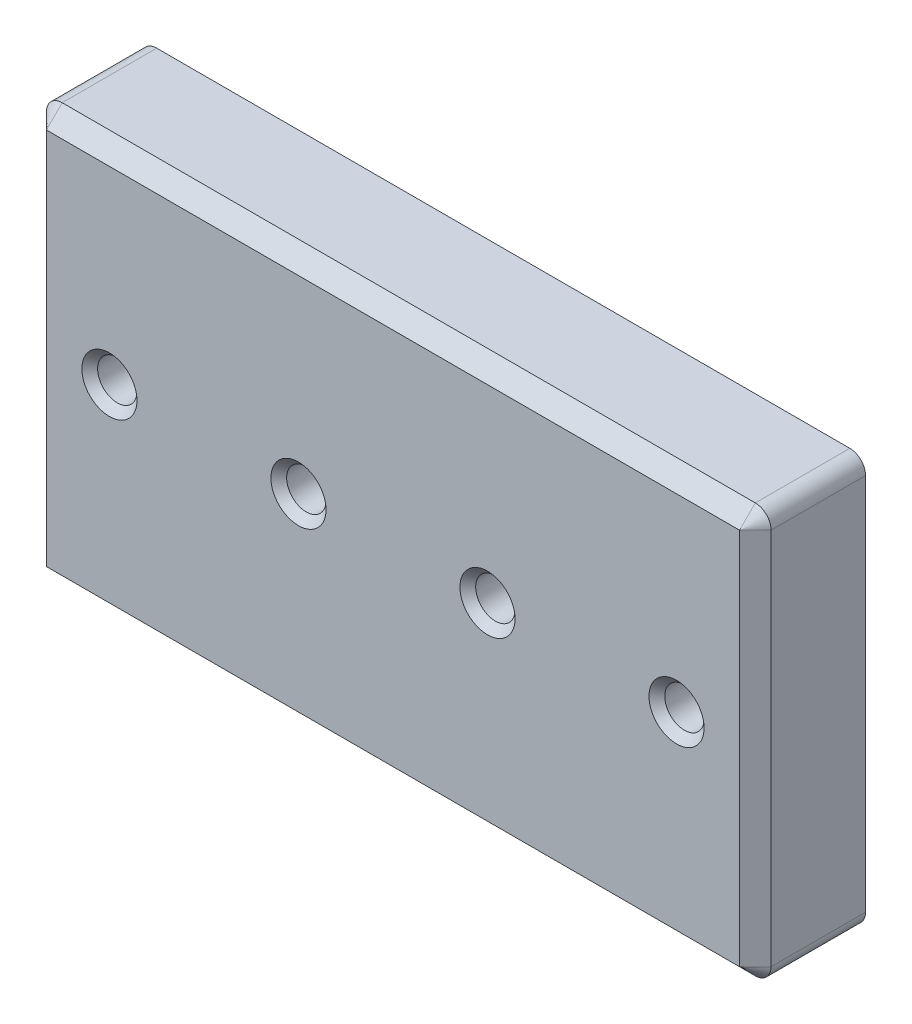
ISO-10303-21;
HEADER;
FILE_DESCRIPTION(('STEP AP214'),'2;1');
FILE_NAME('part.step','',(''),(''),'','','');
FILE_SCHEMA(('AUTOMOTIVE_DESIGN { 1 0 10303 214 1 1 1 1 }'));
ENDSEC;
DATA;
#1=APPLICATION_CONTEXT('core data for automotive mechanical design processes');
#2=APPLICATION_PROTOCOL_DEFINITION('international standard','automotive_design',2000,#1);
#3=PRODUCT_CONTEXT('',#1,'mechanical');
#4=PRODUCT('Part','Part','',(#3));
#5=PRODUCT_RELATED_PRODUCT_CATEGORY('part','',(#4));
#6=PRODUCT_DEFINITION_FORMATION('','',#4);
#7=PRODUCT_DEFINITION_CONTEXT('part definition',#1,'design');
#8=PRODUCT_DEFINITION('design','',#6,#7);
#9=PRODUCT_DEFINITION_SHAPE('','',#8);
#10=(LENGTH_UNIT() NAMED_UNIT(*) SI_UNIT(.MILLI.,.METRE.));
#11=(NAMED_UNIT(*) PLANE_ANGLE_UNIT() SI_UNIT($,.RADIAN.));
#12=(NAMED_UNIT(*) SI_UNIT($,.STERADIAN.) SOLID_ANGLE_UNIT());
#13=UNCERTAINTY_MEASURE_WITH_UNIT(LENGTH_MEASURE(1.E-05),#10,'distance_accuracy_value','');
#14=(GEOMETRIC_REPRESENTATION_CONTEXT(3) GLOBAL_UNCERTAINTY_ASSIGNED_CONTEXT((#13)) GLOBAL_UNIT_ASSIGNED_CONTEXT((#10,
#11,#12)) REPRESENTATION_CONTEXT('',''));
#15=CARTESIAN_POINT('',(0.,0.,0.));
#16=DIRECTION('',(0.,0.,1.));
#17=DIRECTION('',(1.,0.,0.));
#18=AXIS2_PLACEMENT_3D('',#15,#16,#17);
#19=CARTESIAN_POINT('',(0.,0.,7.));
#20=DIRECTION('',(0.,0.,1.));
#21=DIRECTION('',(1.,0.,0.));
#22=AXIS2_PLACEMENT_3D('',#19,#20,#21);
#23=PLANE('',#22);
#24=DIRECTION('',(0.,-1.,0.));
#25=VECTOR('',#24,1.);
#26=CARTESIAN_POINT('',(-22.,-12.,7.));
#27=LINE('',#26,#25);
#28=CARTESIAN_POINT('',(-22.,12.,7.));
#29=VERTEX_POINT('',#28);
#30=CARTESIAN_POINT('',(-22.,-12.,7.));
#31=VERTEX_POINT('',#30);
#32=EDGE_CURVE('E197',#29,#31,#27,.T.);
#33=ORIENTED_EDGE('',*,*,#32,.T.);
#34=DIRECTION('',(1.,0.,0.));
#35=VECTOR('',#34,1.);
#36=CARTESIAN_POINT('',(22.,-12.,7.));
#37=LINE('',#36,#35);
#38=CARTESIAN_POINT('',(22.,-12.,7.));
#39=VERTEX_POINT('',#38);
#40=EDGE_CURVE('E201',#31,#39,#37,.T.);
#41=ORIENTED_EDGE('',*,*,#40,.T.);
#42=DIRECTION('',(0.,1.,0.));
#43=VECTOR('',#42,1.);
#44=CARTESIAN_POINT('',(22.,12.,7.));
#45=LINE('',#44,#43);
#46=CARTESIAN_POINT('',(22.,12.,7.));
#47=VERTEX_POINT('',#46);
#48=EDGE_CURVE('E199',#39,#47,#45,.T.);
#49=ORIENTED_EDGE('',*,*,#48,.T.);
#50=DIRECTION('',(-1.,0.,0.));
#51=VECTOR('',#50,1.);
#52=CARTESIAN_POINT('',(-22.,12.,7.));
#53=LINE('',#52,#51);
#54=EDGE_CURVE('E195',#47,#29,#53,.T.);
#55=ORIENTED_EDGE('',*,*,#54,.T.);
#56=EDGE_LOOP('',(#33,#41,#49,#55));
#57=FACE_BOUND('',#56,.T.);
#58=CARTESIAN_POINT('',(18.,0.,7.));
#59=DIRECTION('',(0.,0.,1.));
#60=DIRECTION('',(1.,0.,0.));
#61=AXIS2_PLACEMENT_3D('',#58,#59,#60);
#62=CIRCLE('',#61,1.75);
#63=CARTESIAN_POINT('',(19.75,0.,7.));
#64=VERTEX_POINT('',#63);
#65=EDGE_CURVE('E166',#64,#64,#62,.F.);
#66=ORIENTED_EDGE('',*,*,#65,.T.);
#67=EDGE_LOOP('',(#66));
#68=FACE_BOUND('',#67,.T.);
#69=CARTESIAN_POINT('',(6.,0.,7.));
#70=DIRECTION('',(0.,0.,1.));
#71=DIRECTION('',(1.,0.,0.));
#72=AXIS2_PLACEMENT_3D('',#69,#70,#71);
#73=CIRCLE('',#72,1.75);
#74=CARTESIAN_POINT('',(7.75,0.,7.));
#75=VERTEX_POINT('',#74);
#76=EDGE_CURVE('E163',#75,#75,#73,.F.);
#77=ORIENTED_EDGE('',*,*,#76,.T.);
#78=EDGE_LOOP('',(#77));
#79=FACE_BOUND('',#78,.T.);
#80=CARTESIAN_POINT('',(-6.,0.,7.));
#81=DIRECTION('',(0.,0.,1.));
#82=DIRECTION('',(1.,0.,0.));
#83=AXIS2_PLACEMENT_3D('',#80,#81,#82);
#84=CIRCLE('',#83,1.75);
#85=CARTESIAN_POINT('',(-4.25,0.,7.));
#86=VERTEX_POINT('',#85);
#87=EDGE_CURVE('E160',#86,#86,#84,.F.);
#88=ORIENTED_EDGE('',*,*,#87,.T.);
#89=EDGE_LOOP('',(#88));
#90=FACE_BOUND('',#89,.T.);
#91=CARTESIAN_POINT('',(-18.,0.,7.));
#92=DIRECTION('',(0.,0.,1.));
#93=DIRECTION('',(1.,0.,0.));
#94=AXIS2_PLACEMENT_3D('',#91,#92,#93);
#95=CIRCLE('',#94,1.75);
#96=CARTESIAN_POINT('',(-16.25,0.,7.));
#97=VERTEX_POINT('',#96);
#98=EDGE_CURVE('E157',#97,#97,#95,.F.);
#99=ORIENTED_EDGE('',*,*,#98,.T.);
#100=EDGE_LOOP('',(#99));
#101=FACE_BOUND('',#100,.T.);
#102=ADVANCED_FACE('F36',(#57,#68,#79,#90,#101),#23,.T.);
#103=CARTESIAN_POINT('',(0.,0.,0.));
#104=DIRECTION('',(0.,0.,1.));
#105=DIRECTION('',(1.,0.,0.));
#106=AXIS2_PLACEMENT_3D('',#103,#104,#105);
#107=PLANE('',#106);
#108=DIRECTION('',(0.,-1.,0.));
#109=VECTOR('',#108,1.);
#110=CARTESIAN_POINT('',(-23.,-13.,0.));
#111=LINE('',#110,#109);
#112=CARTESIAN_POINT('',(-23.,12.,0.));
#113=VERTEX_POINT('',#112);
#114=CARTESIAN_POINT('',(-23.,-12.,0.));
#115=VERTEX_POINT('',#114);
#116=EDGE_CURVE('E119',#113,#115,#111,.T.);
#117=ORIENTED_EDGE('',*,*,#116,.F.);
#118=CARTESIAN_POINT('',(-22.,12.,0.));
#119=DIRECTION('',(0.,0.,1.));
#120=DIRECTION('',(1.,0.,0.));
#121=AXIS2_PLACEMENT_3D('',#118,#119,#120);
#122=CIRCLE('',#121,1.);
#123=CARTESIAN_POINT('',(-22.,13.,0.));
#124=VERTEX_POINT('',#123);
#125=EDGE_CURVE('E126',#113,#124,#122,.F.);
#126=ORIENTED_EDGE('',*,*,#125,.T.);
#127=DIRECTION('',(-1.,0.,0.));
#128=VECTOR('',#127,1.);
#129=CARTESIAN_POINT('',(23.,13.,0.));
#130=LINE('',#129,#128);
#131=CARTESIAN_POINT('',(22.,13.,0.));
#132=VERTEX_POINT('',#131);
#133=EDGE_CURVE('E152',#132,#124,#130,.T.);
#134=ORIENTED_EDGE('',*,*,#133,.F.);
#135=CARTESIAN_POINT('',(22.,12.,0.));
#136=DIRECTION('',(0.,0.,1.));
#137=DIRECTION('',(1.,0.,0.));
#138=AXIS2_PLACEMENT_3D('',#135,#136,#137);
#139=CIRCLE('',#138,1.);
#140=CARTESIAN_POINT('',(23.,12.,0.));
#141=VERTEX_POINT('',#140);
#142=EDGE_CURVE('E133',#132,#141,#139,.F.);
#143=ORIENTED_EDGE('',*,*,#142,.T.);
#144=DIRECTION('',(0.,1.,0.));
#145=VECTOR('',#144,1.);
#146=CARTESIAN_POINT('',(23.,-13.,0.));
#147=LINE('',#146,#145);
#148=CARTESIAN_POINT('',(23.,-12.,0.));
#149=VERTEX_POINT('',#148);
#150=EDGE_CURVE('E143',#149,#141,#147,.T.);
#151=ORIENTED_EDGE('',*,*,#150,.F.);
#152=CARTESIAN_POINT('',(22.,-12.,0.));
#153=DIRECTION('',(0.,0.,1.));
#154=DIRECTION('',(1.,0.,0.));
#155=AXIS2_PLACEMENT_3D('',#152,#153,#154);
#156=CIRCLE('',#155,1.);
#157=CARTESIAN_POINT('',(22.,-13.,0.));
#158=VERTEX_POINT('',#157);
#159=EDGE_CURVE('E180',#149,#158,#156,.F.);
#160=ORIENTED_EDGE('',*,*,#159,.T.);
#161=DIRECTION('',(1.,0.,0.));
#162=VECTOR('',#161,1.);
#163=CARTESIAN_POINT('',(23.,-13.,0.));
#164=LINE('',#163,#162);
#165=CARTESIAN_POINT('',(-22.,-13.,0.));
#166=VERTEX_POINT('',#165);
#167=EDGE_CURVE('E139',#166,#158,#164,.T.);
#168=ORIENTED_EDGE('',*,*,#167,.F.);
#169=CARTESIAN_POINT('',(-22.,-12.,0.));
#170=DIRECTION('',(0.,0.,1.));
#171=DIRECTION('',(1.,0.,0.));
#172=AXIS2_PLACEMENT_3D('',#169,#170,#171);
#173=CIRCLE('',#172,1.);
#174=EDGE_CURVE('E123',#166,#115,#173,.F.);
#175=ORIENTED_EDGE('',*,*,#174,.T.);
#176=EDGE_LOOP('',(#117,#126,#134,#143,#151,#160,#168,#175));
#177=FACE_BOUND('',#176,.T.);
#178=CARTESIAN_POINT('',(-18.,0.,0.));
#179=DIRECTION('',(0.,0.,1.));
#180=DIRECTION('',(1.,0.,0.));
#181=AXIS2_PLACEMENT_3D('',#178,#179,#180);
#182=CIRCLE('',#181,1.25);
#183=CARTESIAN_POINT('',(-16.75,0.,0.));
#184=VERTEX_POINT('',#183);
#185=EDGE_CURVE('E140',#184,#184,#182,.T.);
#186=ORIENTED_EDGE('',*,*,#185,.T.);
#187=EDGE_LOOP('',(#186));
#188=FACE_BOUND('',#187,.T.);
#189=CARTESIAN_POINT('',(18.,0.,0.));
#190=DIRECTION('',(0.,0.,1.));
#191=DIRECTION('',(1.,0.,0.));
#192=AXIS2_PLACEMENT_3D('',#189,#190,#191);
#193=CIRCLE('',#192,1.25);
#194=CARTESIAN_POINT('',(19.25,0.,0.));
#195=VERTEX_POINT('',#194);
#196=EDGE_CURVE('E146',#195,#195,#193,.T.);
#197=ORIENTED_EDGE('',*,*,#196,.T.);
#198=EDGE_LOOP('',(#197));
#199=FACE_BOUND('',#198,.T.);
#200=CARTESIAN_POINT('',(6.,0.,0.));
#201=DIRECTION('',(0.,0.,1.));
#202=DIRECTION('',(1.,0.,0.));
#203=AXIS2_PLACEMENT_3D('',#200,#201,#202);
#204=CIRCLE('',#203,1.25);
#205=CARTESIAN_POINT('',(7.25,0.,0.));
#206=VERTEX_POINT('',#205);
#207=EDGE_CURVE('E244',#206,#206,#204,.T.);
#208=ORIENTED_EDGE('',*,*,#207,.T.);
#209=EDGE_LOOP('',(#208));
#210=FACE_BOUND('',#209,.T.);
#211=CARTESIAN_POINT('',(-6.,0.,0.));
#212=DIRECTION('',(0.,0.,1.));
#213=DIRECTION('',(1.,0.,0.));
#214=AXIS2_PLACEMENT_3D('',#211,#212,#213);
#215=CIRCLE('',#214,1.25);
#216=CARTESIAN_POINT('',(-4.75,0.,0.));
#217=VERTEX_POINT('',#216);
#218=EDGE_CURVE('E239',#217,#217,#215,.T.);
#219=ORIENTED_EDGE('',*,*,#218,.T.);
#220=EDGE_LOOP('',(#219));
#221=FACE_BOUND('',#220,.T.);
#222=ADVANCED_FACE('F135',(#177,#188,#199,#210,#221),#107,.F.);
#223=CARTESIAN_POINT('',(-23.,-13.,7.));
#224=DIRECTION('',(1.,0.,0.));
#225=DIRECTION('',(0.,0.,-1.));
#226=AXIS2_PLACEMENT_3D('',#223,#224,#225);
#227=PLANE('',#226);
#228=DIRECTION('',(0.,0.,-1.));
#229=VECTOR('',#228,1.);
#230=CARTESIAN_POINT('',(-23.,-12.,7.));
#231=LINE('',#230,#229);
#232=CARTESIAN_POINT('',(-23.,-12.,6.));
#233=VERTEX_POINT('',#232);
#234=EDGE_CURVE('E124',#115,#233,#231,.F.);
#235=ORIENTED_EDGE('',*,*,#234,.T.);
#236=DIRECTION('',(0.,1.,0.));
#237=VECTOR('',#236,1.);
#238=CARTESIAN_POINT('',(-23.,12.,6.));
#239=LINE('',#238,#237);
#240=CARTESIAN_POINT('',(-23.,12.,6.));
#241=VERTEX_POINT('',#240);
#242=EDGE_CURVE('E122',#233,#241,#239,.T.);
#243=ORIENTED_EDGE('',*,*,#242,.T.);
#244=DIRECTION('',(0.,0.,-1.));
#245=VECTOR('',#244,1.);
#246=CARTESIAN_POINT('',(-23.,12.,7.));
#247=LINE('',#246,#245);
#248=EDGE_CURVE('E114',#241,#113,#247,.T.);
#249=ORIENTED_EDGE('',*,*,#248,.T.);
#250=ORIENTED_EDGE('',*,*,#116,.T.);
#251=EDGE_LOOP('',(#235,#243,#249,#250));
#252=FACE_BOUND('',#251,.T.);
#253=ADVANCED_FACE('F117',(#252),#227,.F.);
#254=CARTESIAN_POINT('',(23.,-13.,7.));
#255=DIRECTION('',(0.,1.,0.));
#256=DIRECTION('',(0.,0.,1.));
#257=AXIS2_PLACEMENT_3D('',#254,#255,#256);
#258=PLANE('',#257);
#259=DIRECTION('',(0.,0.,-1.));
#260=VECTOR('',#259,1.);
#261=CARTESIAN_POINT('',(22.,-13.,7.));
#262=LINE('',#261,#260);
#263=CARTESIAN_POINT('',(22.,-13.,6.));
#264=VERTEX_POINT('',#263);
#265=EDGE_CURVE('E192',#158,#264,#262,.F.);
#266=ORIENTED_EDGE('',*,*,#265,.T.);
#267=DIRECTION('',(-1.,0.,0.));
#268=VECTOR('',#267,1.);
#269=CARTESIAN_POINT('',(-22.,-13.,6.));
#270=LINE('',#269,#268);
#271=CARTESIAN_POINT('',(-22.,-13.,6.));
#272=VERTEX_POINT('',#271);
#273=EDGE_CURVE('E204',#264,#272,#270,.T.);
#274=ORIENTED_EDGE('',*,*,#273,.T.);
#275=DIRECTION('',(0.,0.,-1.));
#276=VECTOR('',#275,1.);
#277=CARTESIAN_POINT('',(-22.,-13.,7.));
#278=LINE('',#277,#276);
#279=EDGE_CURVE('E190',#272,#166,#278,.T.);
#280=ORIENTED_EDGE('',*,*,#279,.T.);
#281=ORIENTED_EDGE('',*,*,#167,.T.);
#282=EDGE_LOOP('',(#266,#274,#280,#281));
#283=FACE_BOUND('',#282,.T.);
#284=ADVANCED_FACE('F285',(#283),#258,.F.);
#285=CARTESIAN_POINT('',(23.,-13.,7.));
#286=DIRECTION('',(-1.,0.,0.));
#287=DIRECTION('',(0.,0.,1.));
#288=AXIS2_PLACEMENT_3D('',#285,#286,#287);
#289=PLANE('',#288);
#290=DIRECTION('',(0.,0.,-1.));
#291=VECTOR('',#290,1.);
#292=CARTESIAN_POINT('',(23.,12.,7.));
#293=LINE('',#292,#291);
#294=CARTESIAN_POINT('',(23.,12.,6.));
#295=VERTEX_POINT('',#294);
#296=EDGE_CURVE('E187',#141,#295,#293,.F.);
#297=ORIENTED_EDGE('',*,*,#296,.T.);
#298=DIRECTION('',(0.,-1.,0.));
#299=VECTOR('',#298,1.);
#300=CARTESIAN_POINT('',(23.,-12.,6.));
#301=LINE('',#300,#299);
#302=CARTESIAN_POINT('',(23.,-12.,6.));
#303=VERTEX_POINT('',#302);
#304=EDGE_CURVE('E211',#295,#303,#301,.T.);
#305=ORIENTED_EDGE('',*,*,#304,.T.);
#306=DIRECTION('',(0.,0.,-1.));
#307=VECTOR('',#306,1.);
#308=CARTESIAN_POINT('',(23.,-12.,7.));
#309=LINE('',#308,#307);
#310=EDGE_CURVE('E185',#303,#149,#309,.T.);
#311=ORIENTED_EDGE('',*,*,#310,.T.);
#312=ORIENTED_EDGE('',*,*,#150,.T.);
#313=EDGE_LOOP('',(#297,#305,#311,#312));
#314=FACE_BOUND('',#313,.T.);
#315=ADVANCED_FACE('F282',(#314),#289,.F.);
#316=CARTESIAN_POINT('',(23.,13.,7.));
#317=DIRECTION('',(0.,-1.,0.));
#318=DIRECTION('',(1.,0.,0.));
#319=AXIS2_PLACEMENT_3D('',#316,#317,#318);
#320=PLANE('',#319);
#321=DIRECTION('',(0.,0.,-1.));
#322=VECTOR('',#321,1.);
#323=CARTESIAN_POINT('',(-22.,13.,7.));
#324=LINE('',#323,#322);
#325=CARTESIAN_POINT('',(-22.,13.,6.));
#326=VERTEX_POINT('',#325);
#327=EDGE_CURVE('E128',#124,#326,#324,.F.);
#328=ORIENTED_EDGE('',*,*,#327,.T.);
#329=DIRECTION('',(1.,0.,0.));
#330=VECTOR('',#329,1.);
#331=CARTESIAN_POINT('',(22.,13.,6.));
#332=LINE('',#331,#330);
#333=CARTESIAN_POINT('',(22.,13.,6.));
#334=VERTEX_POINT('',#333);
#335=EDGE_CURVE('E11',#326,#334,#332,.T.);
#336=ORIENTED_EDGE('',*,*,#335,.T.);
#337=DIRECTION('',(0.,0.,-1.));
#338=VECTOR('',#337,1.);
#339=CARTESIAN_POINT('',(22.,13.,7.));
#340=LINE('',#339,#338);
#341=EDGE_CURVE('E132',#334,#132,#340,.T.);
#342=ORIENTED_EDGE('',*,*,#341,.T.);
#343=ORIENTED_EDGE('',*,*,#133,.T.);
#344=EDGE_LOOP('',(#328,#336,#342,#343));
#345=FACE_BOUND('',#344,.T.);
#346=ADVANCED_FACE('F268',(#345),#320,.F.);
#347=CARTESIAN_POINT('',(-18.,0.,7.));
#348=DIRECTION('',(0.,0.,-1.));
#349=DIRECTION('',(-1.,0.,0.));
#350=AXIS2_PLACEMENT_3D('',#347,#348,#349);
#351=CYLINDRICAL_SURFACE('',#350,1.25);
#352=CARTESIAN_POINT('',(-18.,0.,6.5));
#353=DIRECTION('',(0.,0.,1.));
#354=DIRECTION('',(1.,0.,0.));
#355=AXIS2_PLACEMENT_3D('',#352,#353,#354);
#356=CIRCLE('',#355,1.25);
#357=CARTESIAN_POINT('',(-16.75,0.,6.5));
#358=VERTEX_POINT('',#357);
#359=EDGE_CURVE('E175',#358,#358,#356,.T.);
#360=ORIENTED_EDGE('',*,*,#359,.T.);
#361=EDGE_LOOP('',(#360));
#362=FACE_BOUND('',#361,.T.);
#363=ORIENTED_EDGE('',*,*,#185,.F.);
#364=EDGE_LOOP('',(#363));
#365=FACE_BOUND('',#364,.T.);
#366=ADVANCED_FACE('F258',(#362,#365),#351,.F.);
#367=CARTESIAN_POINT('',(18.,0.,7.));
#368=DIRECTION('',(0.,0.,-1.));
#369=DIRECTION('',(-1.,0.,0.));
#370=AXIS2_PLACEMENT_3D('',#367,#368,#369);
#371=CYLINDRICAL_SURFACE('',#370,1.25);
#372=CARTESIAN_POINT('',(18.,0.,6.5));
#373=DIRECTION('',(0.,0.,1.));
#374=DIRECTION('',(1.,0.,0.));
#375=AXIS2_PLACEMENT_3D('',#372,#373,#374);
#376=CIRCLE('',#375,1.25);
#377=CARTESIAN_POINT('',(19.25,0.,6.5));
#378=VERTEX_POINT('',#377);
#379=EDGE_CURVE('E154',#378,#378,#376,.T.);
#380=ORIENTED_EDGE('',*,*,#379,.T.);
#381=EDGE_LOOP('',(#380));
#382=FACE_BOUND('',#381,.T.);
#383=ORIENTED_EDGE('',*,*,#196,.F.);
#384=EDGE_LOOP('',(#383));
#385=FACE_BOUND('',#384,.T.);
#386=ADVANCED_FACE('F255',(#382,#385),#371,.F.);
#387=CARTESIAN_POINT('',(6.,0.,7.));
#388=DIRECTION('',(0.,0.,-1.));
#389=DIRECTION('',(-1.,0.,0.));
#390=AXIS2_PLACEMENT_3D('',#387,#388,#389);
#391=CYLINDRICAL_SURFACE('',#390,1.25);
#392=CARTESIAN_POINT('',(6.,0.,6.5));
#393=DIRECTION('',(0.,0.,1.));
#394=DIRECTION('',(1.,0.,0.));
#395=AXIS2_PLACEMENT_3D('',#392,#393,#394);
#396=CIRCLE('',#395,1.25);
#397=CARTESIAN_POINT('',(7.25,0.,6.5));
#398=VERTEX_POINT('',#397);
#399=EDGE_CURVE('E169',#398,#398,#396,.T.);
#400=ORIENTED_EDGE('',*,*,#399,.T.);
#401=EDGE_LOOP('',(#400));
#402=FACE_BOUND('',#401,.T.);
#403=ORIENTED_EDGE('',*,*,#207,.F.);
#404=EDGE_LOOP('',(#403));
#405=FACE_BOUND('',#404,.T.);
#406=ADVANCED_FACE('F257',(#402,#405),#391,.F.);
#407=CARTESIAN_POINT('',(-6.,0.,7.));
#408=DIRECTION('',(0.,0.,-1.));
#409=DIRECTION('',(-1.,0.,0.));
#410=AXIS2_PLACEMENT_3D('',#407,#408,#409);
#411=CYLINDRICAL_SURFACE('',#410,1.25);
#412=CARTESIAN_POINT('',(-6.,0.,6.5));
#413=DIRECTION('',(0.,0.,1.));
#414=DIRECTION('',(1.,0.,0.));
#415=AXIS2_PLACEMENT_3D('',#412,#413,#414);
#416=CIRCLE('',#415,1.25);
#417=CARTESIAN_POINT('',(-4.75,0.,6.5));
#418=VERTEX_POINT('',#417);
#419=EDGE_CURVE('E172',#418,#418,#416,.T.);
#420=ORIENTED_EDGE('',*,*,#419,.T.);
#421=EDGE_LOOP('',(#420));
#422=FACE_BOUND('',#421,.T.);
#423=ORIENTED_EDGE('',*,*,#218,.F.);
#424=EDGE_LOOP('',(#423));
#425=FACE_BOUND('',#424,.T.);
#426=ADVANCED_FACE('F265',(#422,#425),#411,.F.);
#427=CARTESIAN_POINT('',(18.,0.,6.5));
#428=DIRECTION('',(0.,0.,1.));
#429=DIRECTION('',(1.,0.,0.));
#430=AXIS2_PLACEMENT_3D('',#427,#428,#429);
#431=CONICAL_SURFACE('',#430,1.25,0.785398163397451);
#432=ORIENTED_EDGE('',*,*,#65,.F.);
#433=EDGE_LOOP('',(#432));
#434=FACE_BOUND('',#433,.T.);
#435=ORIENTED_EDGE('',*,*,#379,.F.);
#436=EDGE_LOOP('',(#435));
#437=FACE_BOUND('',#436,.T.);
#438=ADVANCED_FACE('F293',(#434,#437),#431,.F.);
#439=CARTESIAN_POINT('',(6.,0.,6.5));
#440=DIRECTION('',(0.,0.,1.));
#441=DIRECTION('',(1.,0.,0.));
#442=AXIS2_PLACEMENT_3D('',#439,#440,#441);
#443=CONICAL_SURFACE('',#442,1.25,0.785398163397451);
#444=ORIENTED_EDGE('',*,*,#76,.F.);
#445=EDGE_LOOP('',(#444));
#446=FACE_BOUND('',#445,.T.);
#447=ORIENTED_EDGE('',*,*,#399,.F.);
#448=EDGE_LOOP('',(#447));
#449=FACE_BOUND('',#448,.T.);
#450=ADVANCED_FACE('F299',(#446,#449),#443,.F.);
#451=CARTESIAN_POINT('',(-6.,0.,6.5));
#452=DIRECTION('',(0.,0.,1.));
#453=DIRECTION('',(1.,0.,0.));
#454=AXIS2_PLACEMENT_3D('',#451,#452,#453);
#455=CONICAL_SURFACE('',#454,1.25,0.785398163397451);
#456=ORIENTED_EDGE('',*,*,#87,.F.);
#457=EDGE_LOOP('',(#456));
#458=FACE_BOUND('',#457,.T.);
#459=ORIENTED_EDGE('',*,*,#419,.F.);
#460=EDGE_LOOP('',(#459));
#461=FACE_BOUND('',#460,.T.);
#462=ADVANCED_FACE('F306',(#458,#461),#455,.F.);
#463=CARTESIAN_POINT('',(-18.,0.,6.5));
#464=DIRECTION('',(0.,0.,1.));
#465=DIRECTION('',(1.,0.,0.));
#466=AXIS2_PLACEMENT_3D('',#463,#464,#465);
#467=CONICAL_SURFACE('',#466,1.25,0.785398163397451);
#468=ORIENTED_EDGE('',*,*,#98,.F.);
#469=EDGE_LOOP('',(#468));
#470=FACE_BOUND('',#469,.T.);
#471=ORIENTED_EDGE('',*,*,#359,.F.);
#472=EDGE_LOOP('',(#471));
#473=FACE_BOUND('',#472,.T.);
#474=ADVANCED_FACE('F313',(#470,#473),#467,.F.);
#475=CARTESIAN_POINT('',(-22.,12.,7.));
#476=DIRECTION('',(0.,0.,-1.));
#477=DIRECTION('',(-1.,0.,0.));
#478=AXIS2_PLACEMENT_3D('',#475,#476,#477);
#479=CYLINDRICAL_SURFACE('',#478,1.);
#480=ORIENTED_EDGE('',*,*,#248,.F.);
#481=CARTESIAN_POINT('',(-22.,12.,6.));
#482=DIRECTION('',(0.,0.,1.));
#483=DIRECTION('',(1.,0.,0.));
#484=AXIS2_PLACEMENT_3D('',#481,#482,#483);
#485=CIRCLE('',#484,1.);
#486=EDGE_CURVE('E46',#241,#326,#485,.F.);
#487=ORIENTED_EDGE('',*,*,#486,.T.);
#488=ORIENTED_EDGE('',*,*,#327,.F.);
#489=ORIENTED_EDGE('',*,*,#125,.F.);
#490=EDGE_LOOP('',(#480,#487,#488,#489));
#491=FACE_BOUND('',#490,.T.);
#492=ADVANCED_FACE('F127',(#491),#479,.T.);
#493=CARTESIAN_POINT('',(22.,12.,7.));
#494=DIRECTION('',(0.,0.,-1.));
#495=DIRECTION('',(-1.,0.,0.));
#496=AXIS2_PLACEMENT_3D('',#493,#494,#495);
#497=CYLINDRICAL_SURFACE('',#496,1.);
#498=ORIENTED_EDGE('',*,*,#341,.F.);
#499=CARTESIAN_POINT('',(22.,12.,6.));
#500=DIRECTION('',(0.,0.,1.));
#501=DIRECTION('',(1.,0.,0.));
#502=AXIS2_PLACEMENT_3D('',#499,#500,#501);
#503=CIRCLE('',#502,1.);
#504=EDGE_CURVE('E214',#334,#295,#503,.F.);
#505=ORIENTED_EDGE('',*,*,#504,.T.);
#506=ORIENTED_EDGE('',*,*,#296,.F.);
#507=ORIENTED_EDGE('',*,*,#142,.F.);
#508=EDGE_LOOP('',(#498,#505,#506,#507));
#509=FACE_BOUND('',#508,.T.);
#510=ADVANCED_FACE('F322',(#509),#497,.T.);
#511=CARTESIAN_POINT('',(22.,-12.,7.));
#512=DIRECTION('',(0.,0.,-1.));
#513=DIRECTION('',(-1.,0.,0.));
#514=AXIS2_PLACEMENT_3D('',#511,#512,#513);
#515=CYLINDRICAL_SURFACE('',#514,1.);
#516=ORIENTED_EDGE('',*,*,#310,.F.);
#517=CARTESIAN_POINT('',(22.,-12.,6.));
#518=DIRECTION('',(0.,0.,1.));
#519=DIRECTION('',(1.,0.,0.));
#520=AXIS2_PLACEMENT_3D('',#517,#518,#519);
#521=CIRCLE('',#520,1.);
#522=EDGE_CURVE('E207',#303,#264,#521,.F.);
#523=ORIENTED_EDGE('',*,*,#522,.T.);
#524=ORIENTED_EDGE('',*,*,#265,.F.);
#525=ORIENTED_EDGE('',*,*,#159,.F.);
#526=EDGE_LOOP('',(#516,#523,#524,#525));
#527=FACE_BOUND('',#526,.T.);
#528=ADVANCED_FACE('F325',(#527),#515,.T.);
#529=CARTESIAN_POINT('',(-22.,-12.,7.));
#530=DIRECTION('',(0.,0.,-1.));
#531=DIRECTION('',(-1.,0.,0.));
#532=AXIS2_PLACEMENT_3D('',#529,#530,#531);
#533=CYLINDRICAL_SURFACE('',#532,1.);
#534=ORIENTED_EDGE('',*,*,#279,.F.);
#535=CARTESIAN_POINT('',(-22.,-12.,6.));
#536=DIRECTION('',(0.,0.,1.));
#537=DIRECTION('',(1.,0.,0.));
#538=AXIS2_PLACEMENT_3D('',#535,#536,#537);
#539=CIRCLE('',#538,1.);
#540=EDGE_CURVE('E209',#272,#233,#539,.F.);
#541=ORIENTED_EDGE('',*,*,#540,.T.);
#542=ORIENTED_EDGE('',*,*,#234,.F.);
#543=ORIENTED_EDGE('',*,*,#174,.F.);
#544=EDGE_LOOP('',(#534,#541,#542,#543));
#545=FACE_BOUND('',#544,.T.);
#546=ADVANCED_FACE('F329',(#545),#533,.T.);
#547=CARTESIAN_POINT('',(0.,12.,7.));
#548=DIRECTION('',(0.,0.707106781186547,0.707106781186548));
#549=DIRECTION('',(1.,0.,0.));
#550=AXIS2_PLACEMENT_3D('',#547,#548,#549);
#551=PLANE('',#550);
#552=DIRECTION('',(0.,-0.707106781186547,0.707106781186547));
#553=VECTOR('',#552,1.);
#554=CARTESIAN_POINT('',(22.,13.,6.));
#555=LINE('',#554,#553);
#556=EDGE_CURVE('E232',#334,#47,#555,.T.);
#557=ORIENTED_EDGE('',*,*,#556,.F.);
#558=ORIENTED_EDGE('',*,*,#335,.F.);
#559=DIRECTION('',(0.,0.707106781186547,-0.707106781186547));
#560=VECTOR('',#559,1.);
#561=CARTESIAN_POINT('',(-22.,12.,7.));
#562=LINE('',#561,#560);
#563=EDGE_CURVE('E41',#29,#326,#562,.T.);
#564=ORIENTED_EDGE('',*,*,#563,.F.);
#565=ORIENTED_EDGE('',*,*,#54,.F.);
#566=EDGE_LOOP('',(#557,#558,#564,#565));
#567=FACE_BOUND('',#566,.T.);
#568=ADVANCED_FACE('F39',(#567),#551,.T.);
#569=CARTESIAN_POINT('',(-22.,12.,6.));
#570=DIRECTION('',(0.,0.,-1.));
#571=DIRECTION('',(-1.,0.,0.));
#572=AXIS2_PLACEMENT_3D('',#569,#570,#571);
#573=CONICAL_SURFACE('',#572,1.,0.785398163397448);
#574=ORIENTED_EDGE('',*,*,#563,.T.);
#575=ORIENTED_EDGE('',*,*,#486,.F.);
#576=DIRECTION('',(-0.707106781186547,0.,-0.707106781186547));
#577=VECTOR('',#576,1.);
#578=CARTESIAN_POINT('',(-22.,12.,7.));
#579=LINE('',#578,#577);
#580=EDGE_CURVE('E230',#29,#241,#579,.T.);
#581=ORIENTED_EDGE('',*,*,#580,.F.);
#582=EDGE_LOOP('',(#574,#575,#581));
#583=FACE_BOUND('',#582,.T.);
#584=ADVANCED_FACE('F375',(#583),#573,.T.);
#585=CARTESIAN_POINT('',(22.,12.,6.));
#586=DIRECTION('',(0.,0.,-1.));
#587=DIRECTION('',(-1.,0.,0.));
#588=AXIS2_PLACEMENT_3D('',#585,#586,#587);
#589=CONICAL_SURFACE('',#588,1.,0.785398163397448);
#590=ORIENTED_EDGE('',*,*,#504,.F.);
#591=ORIENTED_EDGE('',*,*,#556,.T.);
#592=DIRECTION('',(-0.707106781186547,0.,0.707106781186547));
#593=VECTOR('',#592,1.);
#594=CARTESIAN_POINT('',(23.,12.,6.));
#595=LINE('',#594,#593);
#596=EDGE_CURVE('E227',#295,#47,#595,.T.);
#597=ORIENTED_EDGE('',*,*,#596,.F.);
#598=EDGE_LOOP('',(#590,#591,#597));
#599=FACE_BOUND('',#598,.T.);
#600=ADVANCED_FACE('F369',(#599),#589,.T.);
#601=CARTESIAN_POINT('',(-22.,0.,7.));
#602=DIRECTION('',(-0.707106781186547,0.,0.707106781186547));
#603=DIRECTION('',(0.,1.,0.));
#604=AXIS2_PLACEMENT_3D('',#601,#602,#603);
#605=PLANE('',#604);
#606=ORIENTED_EDGE('',*,*,#580,.T.);
#607=ORIENTED_EDGE('',*,*,#242,.F.);
#608=DIRECTION('',(-0.707106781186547,0.,-0.707106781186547));
#609=VECTOR('',#608,1.);
#610=CARTESIAN_POINT('',(-22.,-12.,7.));
#611=LINE('',#610,#609);
#612=EDGE_CURVE('E224',#31,#233,#611,.T.);
#613=ORIENTED_EDGE('',*,*,#612,.F.);
#614=ORIENTED_EDGE('',*,*,#32,.F.);
#615=EDGE_LOOP('',(#606,#607,#613,#614));
#616=FACE_BOUND('',#615,.T.);
#617=ADVANCED_FACE('F362',(#616),#605,.T.);
#618=CARTESIAN_POINT('',(22.,0.,7.));
#619=DIRECTION('',(0.707106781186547,0.,0.707106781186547));
#620=DIRECTION('',(0.,-1.,0.));
#621=AXIS2_PLACEMENT_3D('',#618,#619,#620);
#622=PLANE('',#621);
#623=ORIENTED_EDGE('',*,*,#596,.T.);
#624=ORIENTED_EDGE('',*,*,#48,.F.);
#625=DIRECTION('',(-0.707106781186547,0.,0.707106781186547));
#626=VECTOR('',#625,1.);
#627=CARTESIAN_POINT('',(23.,-12.,6.));
#628=LINE('',#627,#626);
#629=EDGE_CURVE('E221',#303,#39,#628,.T.);
#630=ORIENTED_EDGE('',*,*,#629,.F.);
#631=ORIENTED_EDGE('',*,*,#304,.F.);
#632=EDGE_LOOP('',(#623,#624,#630,#631));
#633=FACE_BOUND('',#632,.T.);
#634=ADVANCED_FACE('F355',(#633),#622,.T.);
#635=CARTESIAN_POINT('',(-22.,-12.,6.));
#636=DIRECTION('',(0.,0.,-1.));
#637=DIRECTION('',(-1.,0.,0.));
#638=AXIS2_PLACEMENT_3D('',#635,#636,#637);
#639=CONICAL_SURFACE('',#638,1.,0.785398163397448);
#640=ORIENTED_EDGE('',*,*,#612,.T.);
#641=ORIENTED_EDGE('',*,*,#540,.F.);
#642=DIRECTION('',(0.,-0.707106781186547,-0.707106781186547));
#643=VECTOR('',#642,1.);
#644=CARTESIAN_POINT('',(-22.,-12.,7.));
#645=LINE('',#644,#643);
#646=EDGE_CURVE('E219',#31,#272,#645,.T.);
#647=ORIENTED_EDGE('',*,*,#646,.F.);
#648=EDGE_LOOP('',(#640,#641,#647));
#649=FACE_BOUND('',#648,.T.);
#650=ADVANCED_FACE('F348',(#649),#639,.T.);
#651=CARTESIAN_POINT('',(22.,-12.,6.));
#652=DIRECTION('',(0.,0.,-1.));
#653=DIRECTION('',(-1.,0.,0.));
#654=AXIS2_PLACEMENT_3D('',#651,#652,#653);
#655=CONICAL_SURFACE('',#654,1.,0.785398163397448);
#656=ORIENTED_EDGE('',*,*,#522,.F.);
#657=ORIENTED_EDGE('',*,*,#629,.T.);
#658=DIRECTION('',(0.,0.707106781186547,0.707106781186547));
#659=VECTOR('',#658,1.);
#660=CARTESIAN_POINT('',(22.,-13.,6.));
#661=LINE('',#660,#659);
#662=EDGE_CURVE('E217',#264,#39,#661,.T.);
#663=ORIENTED_EDGE('',*,*,#662,.F.);
#664=EDGE_LOOP('',(#656,#657,#663));
#665=FACE_BOUND('',#664,.T.);
#666=ADVANCED_FACE('F341',(#665),#655,.T.);
#667=CARTESIAN_POINT('',(0.,-12.,7.));
#668=DIRECTION('',(0.,-0.707106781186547,0.707106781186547));
#669=DIRECTION('',(-1.,0.,0.));
#670=AXIS2_PLACEMENT_3D('',#667,#668,#669);
#671=PLANE('',#670);
#672=ORIENTED_EDGE('',*,*,#646,.T.);
#673=ORIENTED_EDGE('',*,*,#273,.F.);
#674=ORIENTED_EDGE('',*,*,#662,.T.);
#675=ORIENTED_EDGE('',*,*,#40,.F.);
#676=EDGE_LOOP('',(#672,#673,#674,#675));
#677=FACE_BOUND('',#676,.T.);
#678=ADVANCED_FACE('F335',(#677),#671,.T.);
#679=CLOSED_SHELL('',(#102,#222,#253,#284,#315,#346,#366,#386,#406,#426,#438,#450,#462,#474,
#492,#510,#528,#546,#568,#584,#600,#617,#634,#650,#666,#678));
#680=MANIFOLD_SOLID_BREP('B2',#679);
#681=ADVANCED_BREP_SHAPE_REPRESENTATION('',(#18,#680),#14);
#682=SHAPE_DEFINITION_REPRESENTATION(#9,#681);
ENDSEC;
END-ISO-10303-21;
